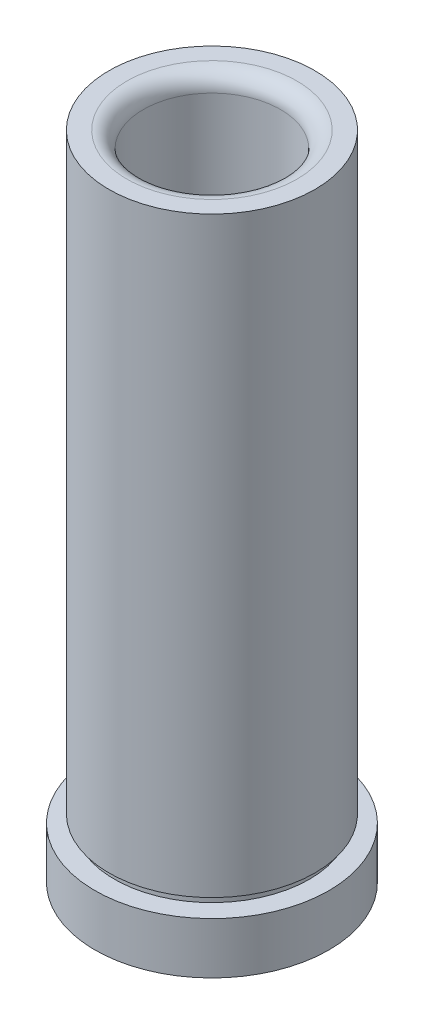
ISO-10303-21;
HEADER;
FILE_DESCRIPTION(('STEP AP214'),'2;1');
FILE_NAME('part.step','',(''),(''),'','','');
FILE_SCHEMA(('AUTOMOTIVE_DESIGN { 1 0 10303 214 1 1 1 1 }'));
ENDSEC;
DATA;
#1=APPLICATION_CONTEXT('core data for automotive mechanical design processes');
#2=APPLICATION_PROTOCOL_DEFINITION('international standard','automotive_design',2000,#1);
#3=PRODUCT_CONTEXT('',#1,'mechanical');
#4=PRODUCT('Part','Part','',(#3));
#5=PRODUCT_RELATED_PRODUCT_CATEGORY('part','',(#4));
#6=PRODUCT_DEFINITION_FORMATION('','',#4);
#7=PRODUCT_DEFINITION_CONTEXT('part definition',#1,'design');
#8=PRODUCT_DEFINITION('design','',#6,#7);
#9=PRODUCT_DEFINITION_SHAPE('','',#8);
#10=(LENGTH_UNIT() NAMED_UNIT(*) SI_UNIT(.MILLI.,.METRE.));
#11=(NAMED_UNIT(*) PLANE_ANGLE_UNIT() SI_UNIT($,.RADIAN.));
#12=(NAMED_UNIT(*) SI_UNIT($,.STERADIAN.) SOLID_ANGLE_UNIT());
#13=UNCERTAINTY_MEASURE_WITH_UNIT(LENGTH_MEASURE(1.E-05),#10,'distance_accuracy_value','');
#14=(GEOMETRIC_REPRESENTATION_CONTEXT(3) GLOBAL_UNCERTAINTY_ASSIGNED_CONTEXT((#13)) GLOBAL_UNIT_ASSIGNED_CONTEXT((#10,
#11,#12)) REPRESENTATION_CONTEXT('',''));
#15=CARTESIAN_POINT('',(0.,0.,0.));
#16=DIRECTION('',(0.,0.,1.));
#17=DIRECTION('',(1.,0.,0.));
#18=AXIS2_PLACEMENT_3D('',#15,#16,#17);
#19=CARTESIAN_POINT('',(-9.53135,60.325,0.));
#20=DIRECTION('',(0.,-1.,0.));
#21=DIRECTION('',(1.,0.,0.));
#22=AXIS2_PLACEMENT_3D('',#19,#20,#21);
#23=PLANE('',#22);
#24=CARTESIAN_POINT('',(-2.10623733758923E-13,60.325,0.));
#25=DIRECTION('',(0.,-1.,0.));
#26=DIRECTION('',(1.,0.,0.));
#27=AXIS2_PLACEMENT_3D('',#24,#25,#26);
#28=CIRCLE('',#27,7.87399999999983);
#29=CARTESIAN_POINT('',(7.87399999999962,60.3250000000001,0.));
#30=VERTEX_POINT('',#29);
#31=EDGE_CURVE('E43',#30,#30,#28,.T.);
#32=ORIENTED_EDGE('',*,*,#31,.T.);
#33=EDGE_LOOP('',(#32));
#34=FACE_BOUND('',#33,.T.);
#35=CARTESIAN_POINT('',(-2.10623733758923E-13,60.325,0.));
#36=DIRECTION('',(0.,-1.,0.));
#37=DIRECTION('',(1.,0.,0.));
#38=AXIS2_PLACEMENT_3D('',#35,#36,#37);
#39=CIRCLE('',#38,9.53134999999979);
#40=CARTESIAN_POINT('',(9.53134999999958,60.325,0.));
#41=VERTEX_POINT('',#40);
#42=EDGE_CURVE('E48',#41,#41,#39,.T.);
#43=ORIENTED_EDGE('',*,*,#42,.F.);
#44=EDGE_LOOP('',(#43));
#45=FACE_BOUND('',#44,.T.);
#46=ADVANCED_FACE('F28',(#34,#45),#23,.F.);
#47=CARTESIAN_POINT('',(3.49148336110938E-12,-1000.,0.));
#48=DIRECTION('',(0.,-1.,0.));
#49=DIRECTION('',(1.,0.,0.));
#50=AXIS2_PLACEMENT_3D('',#47,#48,#49);
#51=CYLINDRICAL_SURFACE('',#50,9.53134999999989);
#52=CARTESIAN_POINT('',(0.,5.52449999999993,0.));
#53=DIRECTION('',(0.,-1.,0.));
#54=DIRECTION('',(1.,0.,0.));
#55=AXIS2_PLACEMENT_3D('',#52,#53,#54);
#56=CIRCLE('',#55,9.53134999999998);
#57=CARTESIAN_POINT('',(9.53134999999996,5.52449999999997,0.));
#58=VERTEX_POINT('',#57);
#59=EDGE_CURVE('E51',#58,#58,#56,.T.);
#60=ORIENTED_EDGE('',*,*,#59,.F.);
#61=EDGE_LOOP('',(#60));
#62=FACE_BOUND('',#61,.T.);
#63=ORIENTED_EDGE('',*,*,#42,.T.);
#64=EDGE_LOOP('',(#63));
#65=FACE_BOUND('',#64,.T.);
#66=ADVANCED_FACE('F91',(#62,#65),#51,.T.);
#67=CARTESIAN_POINT('',(-9.53135,5.5245,0.));
#68=DIRECTION('',(0.,1.,0.));
#69=DIRECTION('',(-1.,0.,0.));
#70=AXIS2_PLACEMENT_3D('',#67,#68,#69);
#71=PLANE('',#70);
#72=CARTESIAN_POINT('',(0.,5.52449999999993,0.));
#73=DIRECTION('',(0.,-1.,0.));
#74=DIRECTION('',(1.,0.,0.));
#75=AXIS2_PLACEMENT_3D('',#72,#73,#74);
#76=CIRCLE('',#75,9.02334999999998);
#77=CARTESIAN_POINT('',(9.02334999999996,5.52449999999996,0.));
#78=VERTEX_POINT('',#77);
#79=EDGE_CURVE('E54',#78,#78,#76,.T.);
#80=ORIENTED_EDGE('',*,*,#79,.F.);
#81=EDGE_LOOP('',(#80));
#82=FACE_BOUND('',#81,.T.);
#83=ORIENTED_EDGE('',*,*,#59,.T.);
#84=EDGE_LOOP('',(#83));
#85=FACE_BOUND('',#84,.T.);
#86=ADVANCED_FACE('F97',(#82,#85),#71,.F.);
#87=CARTESIAN_POINT('',(3.49148336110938E-12,-1000.,0.));
#88=DIRECTION('',(0.,-1.,0.));
#89=DIRECTION('',(1.,0.,0.));
#90=AXIS2_PLACEMENT_3D('',#87,#88,#89);
#91=CYLINDRICAL_SURFACE('',#90,9.02334999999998);
#92=CARTESIAN_POINT('',(0.,4.7625,0.));
#93=DIRECTION('',(0.,-1.,0.));
#94=DIRECTION('',(1.,0.,0.));
#95=AXIS2_PLACEMENT_3D('',#92,#93,#94);
#96=CIRCLE('',#95,9.02334999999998);
#97=CARTESIAN_POINT('',(9.02334999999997,4.76250000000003,0.));
#98=VERTEX_POINT('',#97);
#99=EDGE_CURVE('E57',#98,#98,#96,.T.);
#100=ORIENTED_EDGE('',*,*,#99,.F.);
#101=EDGE_LOOP('',(#100));
#102=FACE_BOUND('',#101,.T.);
#103=ORIENTED_EDGE('',*,*,#79,.T.);
#104=EDGE_LOOP('',(#103));
#105=FACE_BOUND('',#104,.T.);
#106=ADVANCED_FACE('F146',(#102,#105),#91,.T.);
#107=CARTESIAN_POINT('',(-10.8331,4.7625,0.));
#108=DIRECTION('',(0.,-1.,0.));
#109=DIRECTION('',(1.,0.,0.));
#110=AXIS2_PLACEMENT_3D('',#107,#108,#109);
#111=PLANE('',#110);
#112=CARTESIAN_POINT('',(0.,4.7625,0.));
#113=DIRECTION('',(0.,-1.,0.));
#114=DIRECTION('',(1.,0.,0.));
#115=AXIS2_PLACEMENT_3D('',#112,#113,#114);
#116=CIRCLE('',#115,10.8331);
#117=CARTESIAN_POINT('',(10.8331,4.76250000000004,0.));
#118=VERTEX_POINT('',#117);
#119=EDGE_CURVE('E60',#118,#118,#116,.T.);
#120=ORIENTED_EDGE('',*,*,#119,.F.);
#121=EDGE_LOOP('',(#120));
#122=FACE_BOUND('',#121,.T.);
#123=ORIENTED_EDGE('',*,*,#99,.T.);
#124=EDGE_LOOP('',(#123));
#125=FACE_BOUND('',#124,.T.);
#126=ADVANCED_FACE('F154',(#122,#125),#111,.F.);
#127=CARTESIAN_POINT('',(3.49148336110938E-12,-1000.,0.));
#128=DIRECTION('',(0.,-1.,0.));
#129=DIRECTION('',(1.,0.,0.));
#130=AXIS2_PLACEMENT_3D('',#127,#128,#129);
#131=CYLINDRICAL_SURFACE('',#130,10.8331);
#132=CARTESIAN_POINT('',(0.,0.,0.));
#133=DIRECTION('',(0.,-1.,0.));
#134=DIRECTION('',(1.,0.,0.));
#135=AXIS2_PLACEMENT_3D('',#132,#133,#134);
#136=CIRCLE('',#135,10.8331);
#137=CARTESIAN_POINT('',(10.8331,0.,0.));
#138=VERTEX_POINT('',#137);
#139=EDGE_CURVE('E63',#138,#138,#136,.T.);
#140=ORIENTED_EDGE('',*,*,#139,.F.);
#141=EDGE_LOOP('',(#140));
#142=FACE_BOUND('',#141,.T.);
#143=ORIENTED_EDGE('',*,*,#119,.T.);
#144=EDGE_LOOP('',(#143));
#145=FACE_BOUND('',#144,.T.);
#146=ADVANCED_FACE('F88',(#142,#145),#131,.T.);
#147=CARTESIAN_POINT('',(-7.112,0.,0.));
#148=DIRECTION('',(0.,1.,0.));
#149=DIRECTION('',(-1.,0.,0.));
#150=AXIS2_PLACEMENT_3D('',#147,#148,#149);
#151=PLANE('',#150);
#152=CARTESIAN_POINT('',(0.,0.,0.));
#153=DIRECTION('',(0.,1.,0.));
#154=DIRECTION('',(-1.,0.,0.));
#155=AXIS2_PLACEMENT_3D('',#152,#153,#154);
#156=CIRCLE('',#155,8.63599999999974);
#157=CARTESIAN_POINT('',(-8.63599999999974,0.,0.));
#158=VERTEX_POINT('',#157);
#159=EDGE_CURVE('E10',#158,#158,#156,.T.);
#160=ORIENTED_EDGE('',*,*,#159,.T.);
#161=EDGE_LOOP('',(#160));
#162=FACE_BOUND('',#161,.T.);
#163=ORIENTED_EDGE('',*,*,#139,.T.);
#164=EDGE_LOOP('',(#163));
#165=FACE_BOUND('',#164,.T.);
#166=ADVANCED_FACE('F83',(#162,#165),#151,.F.);
#167=CARTESIAN_POINT('',(3.49148336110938E-12,-1000.,0.));
#168=DIRECTION('',(0.,-1.,0.));
#169=DIRECTION('',(1.,0.,0.));
#170=AXIS2_PLACEMENT_3D('',#167,#168,#169);
#171=CYLINDRICAL_SURFACE('',#170,7.11199999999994);
#172=CARTESIAN_POINT('',(0.,1.52399999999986,0.));
#173=DIRECTION('',(0.,1.,0.));
#174=DIRECTION('',(-1.,0.,0.));
#175=AXIS2_PLACEMENT_3D('',#172,#173,#174);
#176=CIRCLE('',#175,7.11199999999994);
#177=CARTESIAN_POINT('',(-7.11199999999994,1.52399999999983,0.));
#178=VERTEX_POINT('',#177);
#179=EDGE_CURVE('E35',#178,#178,#176,.F.);
#180=ORIENTED_EDGE('',*,*,#179,.T.);
#181=EDGE_LOOP('',(#180));
#182=FACE_BOUND('',#181,.T.);
#183=CARTESIAN_POINT('',(-1.1927954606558E-13,34.1629999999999,0.));
#184=DIRECTION('',(0.,-1.,0.));
#185=DIRECTION('',(1.,0.,0.));
#186=AXIS2_PLACEMENT_3D('',#183,#184,#185);
#187=CIRCLE('',#186,7.11199999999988);
#188=CARTESIAN_POINT('',(7.11199999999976,34.163,0.));
#189=VERTEX_POINT('',#188);
#190=EDGE_CURVE('E66',#189,#189,#187,.T.);
#191=ORIENTED_EDGE('',*,*,#190,.F.);
#192=EDGE_LOOP('',(#191));
#193=FACE_BOUND('',#192,.T.);
#194=ADVANCED_FACE('F78',(#182,#193),#171,.F.);
#195=CARTESIAN_POINT('',(-1.1927954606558E-13,34.1629999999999,0.));
#196=DIRECTION('',(0.,-1.,0.));
#197=DIRECTION('',(1.,0.,0.));
#198=AXIS2_PLACEMENT_3D('',#195,#196,#197);
#199=CONICAL_SURFACE('',#198,7.11199999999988,0.78539816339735);
#200=CARTESIAN_POINT('',(-1.21940056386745E-13,34.9250000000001,0.));
#201=DIRECTION('',(0.,-1.,0.));
#202=DIRECTION('',(1.,0.,0.));
#203=AXIS2_PLACEMENT_3D('',#200,#201,#202);
#204=CIRCLE('',#203,6.34999999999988);
#205=CARTESIAN_POINT('',(6.34999999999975,34.9250000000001,0.));
#206=VERTEX_POINT('',#205);
#207=EDGE_CURVE('E69',#206,#206,#204,.T.);
#208=ORIENTED_EDGE('',*,*,#207,.F.);
#209=EDGE_LOOP('',(#208));
#210=FACE_BOUND('',#209,.T.);
#211=ORIENTED_EDGE('',*,*,#190,.T.);
#212=EDGE_LOOP('',(#211));
#213=FACE_BOUND('',#212,.T.);
#214=ADVANCED_FACE('F75',(#210,#213),#199,.F.);
#215=CARTESIAN_POINT('',(3.49148336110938E-12,-1000.,0.));
#216=DIRECTION('',(0.,-1.,0.));
#217=DIRECTION('',(1.,0.,0.));
#218=AXIS2_PLACEMENT_3D('',#215,#216,#217);
#219=CYLINDRICAL_SURFACE('',#218,6.34999999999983);
#220=CARTESIAN_POINT('',(-2.05302713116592E-13,58.8009999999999,0.));
#221=DIRECTION('',(0.,-1.,0.));
#222=DIRECTION('',(1.,0.,0.));
#223=AXIS2_PLACEMENT_3D('',#220,#221,#222);
#224=CIRCLE('',#223,6.34999999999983);
#225=CARTESIAN_POINT('',(6.34999999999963,58.8009999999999,0.));
#226=VERTEX_POINT('',#225);
#227=EDGE_CURVE('E39',#226,#226,#224,.F.);
#228=ORIENTED_EDGE('',*,*,#227,.T.);
#229=EDGE_LOOP('',(#228));
#230=FACE_BOUND('',#229,.T.);
#231=ORIENTED_EDGE('',*,*,#207,.T.);
#232=EDGE_LOOP('',(#231));
#233=FACE_BOUND('',#232,.T.);
#234=ADVANCED_FACE('F73',(#230,#233),#219,.F.);
#235=CARTESIAN_POINT('',(-2.05302713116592E-13,58.8009999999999,0.));
#236=DIRECTION('',(0.,-1.,0.));
#237=DIRECTION('',(1.,0.,0.));
#238=AXIS2_PLACEMENT_3D('',#235,#236,#237);
#239=TOROIDAL_SURFACE('',#238,7.87399999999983,1.524);
#240=ORIENTED_EDGE('',*,*,#227,.F.);
#241=EDGE_LOOP('',(#240));
#242=FACE_BOUND('',#241,.T.);
#243=ORIENTED_EDGE('',*,*,#31,.F.);
#244=EDGE_LOOP('',(#243));
#245=FACE_BOUND('',#244,.T.);
#246=ADVANCED_FACE('F102',(#242,#245),#239,.T.);
#247=CARTESIAN_POINT('',(0.,1.52399999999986,0.));
#248=DIRECTION('',(0.,-1.,0.));
#249=DIRECTION('',(1.,0.,0.));
#250=AXIS2_PLACEMENT_3D('',#247,#248,#249);
#251=CONICAL_SURFACE('',#250,7.11199999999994,0.785398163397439);
#252=ORIENTED_EDGE('',*,*,#159,.F.);
#253=EDGE_LOOP('',(#252));
#254=FACE_BOUND('',#253,.T.);
#255=ORIENTED_EDGE('',*,*,#179,.F.);
#256=EDGE_LOOP('',(#255));
#257=FACE_BOUND('',#256,.T.);
#258=ADVANCED_FACE('F30',(#254,#257),#251,.F.);
#259=CLOSED_SHELL('',(#46,#66,#86,#106,#126,#146,#166,#194,#214,#234,#246,#258));
#260=MANIFOLD_SOLID_BREP('B2',#259);
#261=ADVANCED_BREP_SHAPE_REPRESENTATION('',(#18,#260),#14);
#262=SHAPE_DEFINITION_REPRESENTATION(#9,#261);
ENDSEC;
END-ISO-10303-21;
